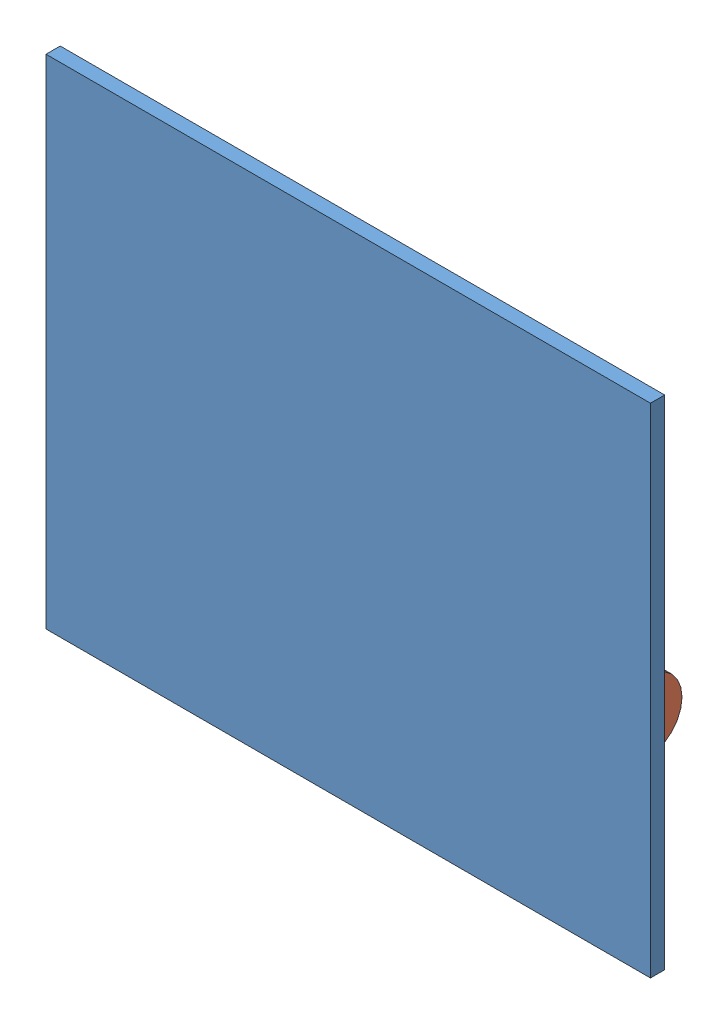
SolidWorks assembly Сборка4.sldasm, configuration Default (file format 3400). Lengths in mm.
Overall size (1746.52 1400 340).
2 component instances, 2 part files, 2 mates.
Components (placement in the parent):
- 01-1: 01.SLDPRT [Default] at (-642.1641 -441.1427 -270.8408) size (1700 1400 40)
- 02-1: 02.SLDPRT [Default] at (193.3152 -23.6219 -420.8408) x (1 0 0) z (0 1 0) size (1544 300 200)
Mates (geometry in assembly coordinates):
- Параллельность2: parallel: line of ?; line of ?
- Совпадение5: coincident anti-aligned: plane of ?; plane of ?
